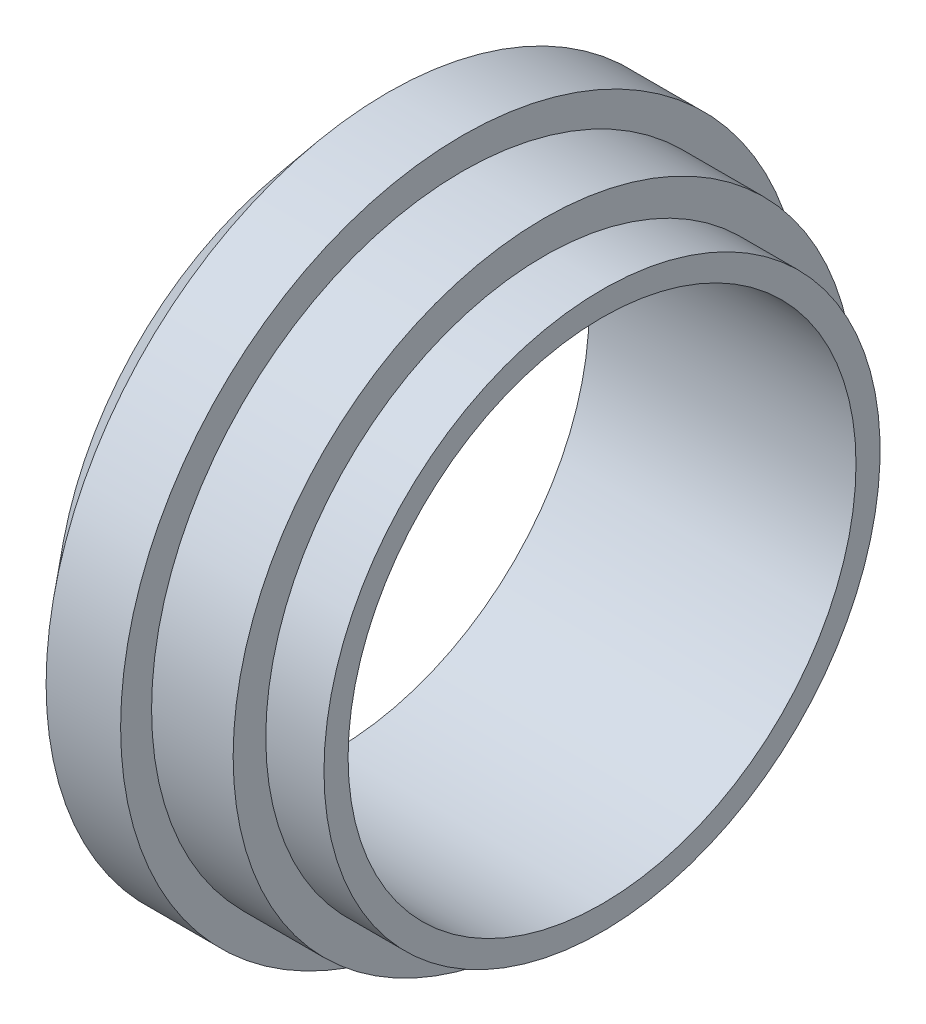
from build123d import *

# Parameters (mm, degrees)
SKETCH4_R          = 17.399
CUT_EXTRUDE1_DEPTH = 52.815218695


with BuildPart() as part:
    # Sketch1 → Revolve1 (revolve)
    with BuildSketch(Plane.XY, mode=Mode.PRIVATE) as revolve1_sk:
        Polygon((0, 0), (-3.9878, 0), (-3.9878, -2.2352), (-9.5758, -2.2352), (-9.5758, -4.3561), (-14.6812, -4.3561), (-18.288, -0.0508), (-18.288, 19.05), (0, 19.05), align=None)
    revolve(revolve1_sk.sketch.rotate(Axis((-18.288, 19.05, 0), (1, 0, 0)), 270), axis=Axis((-18.288, 19.05, 0), (1, 0, 0)))

    # Sketch4 → Cut-Extrude1 (cut, through all)
    with BuildSketch(Plane.ZY.offset(18.288)):
        with Locations((0, 19.05)):
            Circle(SKETCH4_R)
    extrude(amount=-CUT_EXTRUDE1_DEPTH, mode=Mode.SUBTRACT)


solid = part.part
